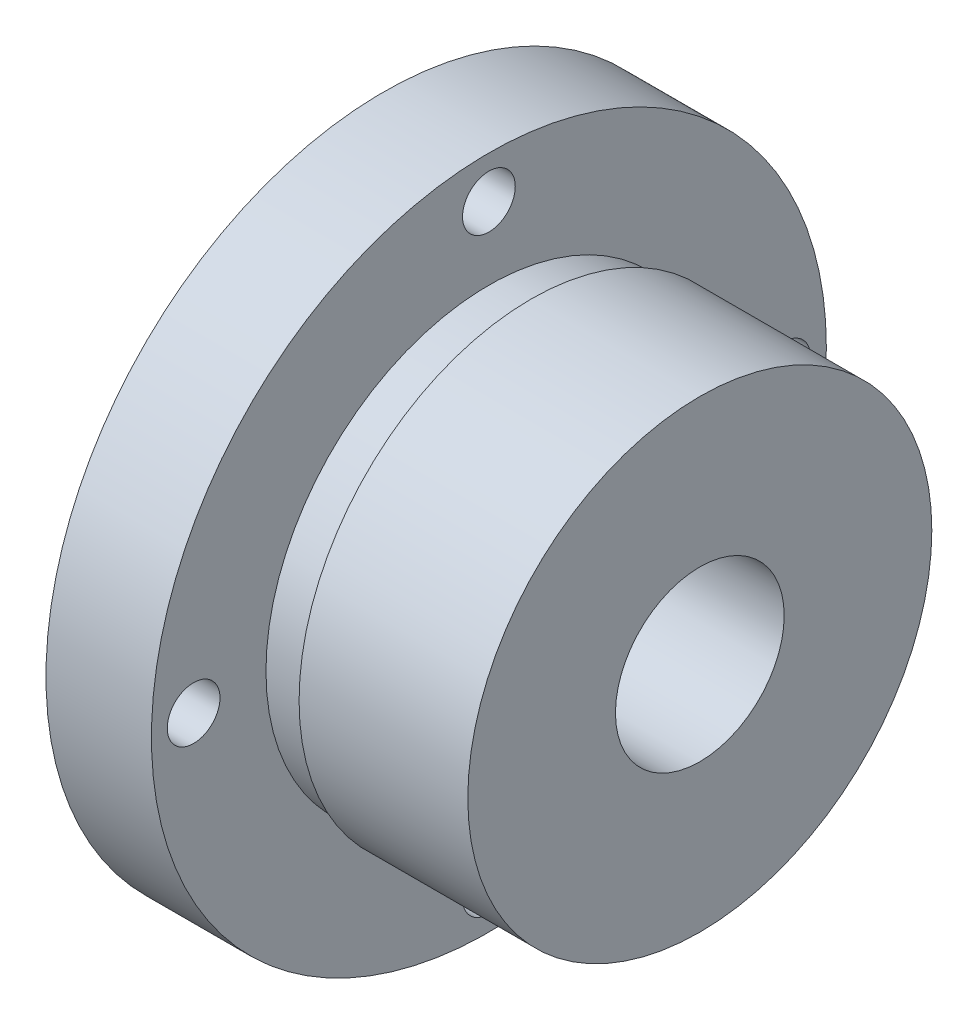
ISO-10303-21;
HEADER;
FILE_DESCRIPTION(('STEP AP214'),'2;1');
FILE_NAME('part.step','',(''),(''),'','','');
FILE_SCHEMA(('AUTOMOTIVE_DESIGN { 1 0 10303 214 1 1 1 1 }'));
ENDSEC;
DATA;
#1=APPLICATION_CONTEXT('core data for automotive mechanical design processes');
#2=APPLICATION_PROTOCOL_DEFINITION('international standard','automotive_design',2000,#1);
#3=PRODUCT_CONTEXT('',#1,'mechanical');
#4=PRODUCT('Part','Part','',(#3));
#5=PRODUCT_RELATED_PRODUCT_CATEGORY('part','',(#4));
#6=PRODUCT_DEFINITION_FORMATION('','',#4);
#7=PRODUCT_DEFINITION_CONTEXT('part definition',#1,'design');
#8=PRODUCT_DEFINITION('design','',#6,#7);
#9=PRODUCT_DEFINITION_SHAPE('','',#8);
#10=(LENGTH_UNIT() NAMED_UNIT(*) SI_UNIT(.MILLI.,.METRE.));
#11=(NAMED_UNIT(*) PLANE_ANGLE_UNIT() SI_UNIT($,.RADIAN.));
#12=(NAMED_UNIT(*) SI_UNIT($,.STERADIAN.) SOLID_ANGLE_UNIT());
#13=UNCERTAINTY_MEASURE_WITH_UNIT(LENGTH_MEASURE(1.E-05),#10,'distance_accuracy_value','');
#14=(GEOMETRIC_REPRESENTATION_CONTEXT(3) GLOBAL_UNCERTAINTY_ASSIGNED_CONTEXT((#13)) GLOBAL_UNIT_ASSIGNED_CONTEXT((#10,
#11,#12)) REPRESENTATION_CONTEXT('',''));
#15=CARTESIAN_POINT('',(0.,0.,0.));
#16=DIRECTION('',(0.,0.,1.));
#17=DIRECTION('',(1.,0.,0.));
#18=AXIS2_PLACEMENT_3D('',#15,#16,#17);
#19=CARTESIAN_POINT('',(0.,0.,0.));
#20=DIRECTION('',(-1.,0.,0.));
#21=DIRECTION('',(0.,0.,1.));
#22=AXIS2_PLACEMENT_3D('',#19,#20,#21);
#23=PLANE('',#22);
#24=CARTESIAN_POINT('',(0.,0.,0.));
#25=DIRECTION('',(-1.,0.,0.));
#26=DIRECTION('',(0.,0.,1.));
#27=AXIS2_PLACEMENT_3D('',#24,#25,#26);
#28=CIRCLE('',#27,4.);
#29=CARTESIAN_POINT('',(0.,0.,4.));
#30=VERTEX_POINT('',#29);
#31=EDGE_CURVE('E83',#30,#30,#28,.T.);
#32=ORIENTED_EDGE('',*,*,#31,.F.);
#33=EDGE_LOOP('',(#32));
#34=FACE_BOUND('',#33,.T.);
#35=CARTESIAN_POINT('',(0.,0.,-14.));
#36=DIRECTION('',(-1.,0.,0.));
#37=DIRECTION('',(0.,0.,1.));
#38=AXIS2_PLACEMENT_3D('',#35,#36,#37);
#39=CIRCLE('',#38,1.24999999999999);
#40=CARTESIAN_POINT('',(0.,0.,-12.75));
#41=VERTEX_POINT('',#40);
#42=EDGE_CURVE('E80',#41,#41,#39,.T.);
#43=ORIENTED_EDGE('',*,*,#42,.F.);
#44=EDGE_LOOP('',(#43));
#45=FACE_BOUND('',#44,.T.);
#46=CARTESIAN_POINT('',(0.,14.,1.46642301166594E-13));
#47=DIRECTION('',(-1.,0.,0.));
#48=DIRECTION('',(0.,0.,1.));
#49=AXIS2_PLACEMENT_3D('',#46,#47,#48);
#50=CIRCLE('',#49,1.24999999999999);
#51=CARTESIAN_POINT('',(0.,14.,1.25000000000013));
#52=VERTEX_POINT('',#51);
#53=EDGE_CURVE('E74',#52,#52,#50,.T.);
#54=ORIENTED_EDGE('',*,*,#53,.F.);
#55=EDGE_LOOP('',(#54));
#56=FACE_BOUND('',#55,.T.);
#57=CARTESIAN_POINT('',(0.,0.,14.));
#58=DIRECTION('',(-1.,0.,0.));
#59=DIRECTION('',(0.,0.,1.));
#60=AXIS2_PLACEMENT_3D('',#57,#58,#59);
#61=CIRCLE('',#60,1.24999999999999);
#62=CARTESIAN_POINT('',(0.,0.,15.25));
#63=VERTEX_POINT('',#62);
#64=EDGE_CURVE('E68',#63,#63,#61,.T.);
#65=ORIENTED_EDGE('',*,*,#64,.F.);
#66=EDGE_LOOP('',(#65));
#67=FACE_BOUND('',#66,.T.);
#68=CARTESIAN_POINT('',(0.,-14.,0.));
#69=DIRECTION('',(-1.,0.,0.));
#70=DIRECTION('',(0.,0.,1.));
#71=AXIS2_PLACEMENT_3D('',#68,#69,#70);
#72=CIRCLE('',#71,1.24999999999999);
#73=CARTESIAN_POINT('',(0.,-14.,1.24999999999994));
#74=VERTEX_POINT('',#73);
#75=EDGE_CURVE('E62',#74,#74,#72,.T.);
#76=ORIENTED_EDGE('',*,*,#75,.F.);
#77=EDGE_LOOP('',(#76));
#78=FACE_BOUND('',#77,.T.);
#79=CARTESIAN_POINT('',(0.,0.,0.));
#80=DIRECTION('',(1.,0.,0.));
#81=DIRECTION('',(0.,0.,-1.));
#82=AXIS2_PLACEMENT_3D('',#79,#80,#81);
#83=CIRCLE('',#82,16.);
#84=CARTESIAN_POINT('',(0.,0.,-16.));
#85=VERTEX_POINT('',#84);
#86=EDGE_CURVE('E10',#85,#85,#83,.T.);
#87=ORIENTED_EDGE('',*,*,#86,.F.);
#88=EDGE_LOOP('',(#87));
#89=FACE_BOUND('',#88,.T.);
#90=ADVANCED_FACE('F34',(#34,#45,#56,#67,#78,#89),#23,.T.);
#91=CARTESIAN_POINT('',(15.,0.,0.));
#92=DIRECTION('',(1.,0.,0.));
#93=DIRECTION('',(0.,0.,-1.));
#94=AXIS2_PLACEMENT_3D('',#91,#92,#93);
#95=CYLINDRICAL_SURFACE('',#94,16.);
#96=ORIENTED_EDGE('',*,*,#86,.T.);
#97=EDGE_LOOP('',(#96));
#98=FACE_BOUND('',#97,.T.);
#99=CARTESIAN_POINT('',(5.,0.,0.));
#100=DIRECTION('',(1.,0.,0.));
#101=DIRECTION('',(0.,0.,-1.));
#102=AXIS2_PLACEMENT_3D('',#99,#100,#101);
#103=CIRCLE('',#102,16.);
#104=CARTESIAN_POINT('',(5.,0.,-16.));
#105=VERTEX_POINT('',#104);
#106=EDGE_CURVE('E40',#105,#105,#103,.T.);
#107=ORIENTED_EDGE('',*,*,#106,.F.);
#108=EDGE_LOOP('',(#107));
#109=FACE_BOUND('',#108,.T.);
#110=ADVANCED_FACE('F94',(#98,#109),#95,.T.);
#111=CARTESIAN_POINT('',(5.,16.,0.));
#112=DIRECTION('',(1.,0.,0.));
#113=DIRECTION('',(0.,0.,-1.));
#114=AXIS2_PLACEMENT_3D('',#111,#112,#113);
#115=PLANE('',#114);
#116=CARTESIAN_POINT('',(5.,0.,-14.));
#117=DIRECTION('',(1.,0.,0.));
#118=DIRECTION('',(0.,0.,-1.));
#119=AXIS2_PLACEMENT_3D('',#116,#117,#118);
#120=CIRCLE('',#119,1.24999999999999);
#121=CARTESIAN_POINT('',(5.,0.,-15.25));
#122=VERTEX_POINT('',#121);
#123=EDGE_CURVE('E77',#122,#122,#120,.T.);
#124=ORIENTED_EDGE('',*,*,#123,.F.);
#125=EDGE_LOOP('',(#124));
#126=FACE_BOUND('',#125,.T.);
#127=CARTESIAN_POINT('',(5.,14.,1.46642301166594E-13));
#128=DIRECTION('',(1.,0.,0.));
#129=DIRECTION('',(0.,0.,-1.));
#130=AXIS2_PLACEMENT_3D('',#127,#128,#129);
#131=CIRCLE('',#130,1.24999999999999);
#132=CARTESIAN_POINT('',(5.,14.,-1.24999999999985));
#133=VERTEX_POINT('',#132);
#134=EDGE_CURVE('E71',#133,#133,#131,.T.);
#135=ORIENTED_EDGE('',*,*,#134,.F.);
#136=EDGE_LOOP('',(#135));
#137=FACE_BOUND('',#136,.T.);
#138=CARTESIAN_POINT('',(5.,0.,14.));
#139=DIRECTION('',(1.,0.,0.));
#140=DIRECTION('',(0.,0.,-1.));
#141=AXIS2_PLACEMENT_3D('',#138,#139,#140);
#142=CIRCLE('',#141,1.24999999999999);
#143=CARTESIAN_POINT('',(5.,0.,12.75));
#144=VERTEX_POINT('',#143);
#145=EDGE_CURVE('E65',#144,#144,#142,.T.);
#146=ORIENTED_EDGE('',*,*,#145,.F.);
#147=EDGE_LOOP('',(#146));
#148=FACE_BOUND('',#147,.T.);
#149=CARTESIAN_POINT('',(5.,-14.,0.));
#150=DIRECTION('',(1.,0.,0.));
#151=DIRECTION('',(0.,0.,-1.));
#152=AXIS2_PLACEMENT_3D('',#149,#150,#151);
#153=CIRCLE('',#152,1.24999999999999);
#154=CARTESIAN_POINT('',(5.,-14.,-1.25000000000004));
#155=VERTEX_POINT('',#154);
#156=EDGE_CURVE('E59',#155,#155,#153,.T.);
#157=ORIENTED_EDGE('',*,*,#156,.F.);
#158=EDGE_LOOP('',(#157));
#159=FACE_BOUND('',#158,.T.);
#160=ORIENTED_EDGE('',*,*,#106,.T.);
#161=EDGE_LOOP('',(#160));
#162=FACE_BOUND('',#161,.T.);
#163=CARTESIAN_POINT('',(5.,0.,0.));
#164=DIRECTION('',(1.,0.,0.));
#165=DIRECTION('',(0.,0.,-1.));
#166=AXIS2_PLACEMENT_3D('',#163,#164,#165);
#167=CIRCLE('',#166,10.57);
#168=CARTESIAN_POINT('',(5.,0.,-10.57));
#169=VERTEX_POINT('',#168);
#170=EDGE_CURVE('E44',#169,#169,#167,.T.);
#171=ORIENTED_EDGE('',*,*,#170,.F.);
#172=EDGE_LOOP('',(#171));
#173=FACE_BOUND('',#172,.T.);
#174=ADVANCED_FACE('F112',(#126,#137,#148,#159,#162,#173),#115,.T.);
#175=CARTESIAN_POINT('',(15.,0.,0.));
#176=DIRECTION('',(1.,0.,0.));
#177=DIRECTION('',(0.,0.,-1.));
#178=AXIS2_PLACEMENT_3D('',#175,#176,#177);
#179=CYLINDRICAL_SURFACE('',#178,10.57);
#180=ORIENTED_EDGE('',*,*,#170,.T.);
#181=EDGE_LOOP('',(#180));
#182=FACE_BOUND('',#181,.T.);
#183=CARTESIAN_POINT('',(7.,0.,0.));
#184=DIRECTION('',(1.,0.,0.));
#185=DIRECTION('',(0.,0.,-1.));
#186=AXIS2_PLACEMENT_3D('',#183,#184,#185);
#187=CIRCLE('',#186,10.57);
#188=CARTESIAN_POINT('',(7.,0.,-10.57));
#189=VERTEX_POINT('',#188);
#190=EDGE_CURVE('E48',#189,#189,#187,.T.);
#191=ORIENTED_EDGE('',*,*,#190,.F.);
#192=EDGE_LOOP('',(#191));
#193=FACE_BOUND('',#192,.T.);
#194=ADVANCED_FACE('F114',(#182,#193),#179,.T.);
#195=CARTESIAN_POINT('',(7.,10.57,0.));
#196=DIRECTION('',(-1.,0.,0.));
#197=DIRECTION('',(0.,0.,1.));
#198=AXIS2_PLACEMENT_3D('',#195,#196,#197);
#199=PLANE('',#198);
#200=ORIENTED_EDGE('',*,*,#190,.T.);
#201=EDGE_LOOP('',(#200));
#202=FACE_BOUND('',#201,.T.);
#203=CARTESIAN_POINT('',(7.,0.,0.));
#204=DIRECTION('',(1.,0.,0.));
#205=DIRECTION('',(0.,0.,-1.));
#206=AXIS2_PLACEMENT_3D('',#203,#204,#205);
#207=CIRCLE('',#206,11.);
#208=CARTESIAN_POINT('',(7.,0.,-11.));
#209=VERTEX_POINT('',#208);
#210=EDGE_CURVE('E53',#209,#209,#207,.T.);
#211=ORIENTED_EDGE('',*,*,#210,.F.);
#212=EDGE_LOOP('',(#211));
#213=FACE_BOUND('',#212,.T.);
#214=ADVANCED_FACE('F122',(#202,#213),#199,.T.);
#215=CARTESIAN_POINT('',(15.,0.,0.));
#216=DIRECTION('',(1.,0.,0.));
#217=DIRECTION('',(0.,0.,-1.));
#218=AXIS2_PLACEMENT_3D('',#215,#216,#217);
#219=CYLINDRICAL_SURFACE('',#218,11.);
#220=ORIENTED_EDGE('',*,*,#210,.T.);
#221=EDGE_LOOP('',(#220));
#222=FACE_BOUND('',#221,.T.);
#223=CARTESIAN_POINT('',(15.,0.,0.));
#224=DIRECTION('',(1.,0.,0.));
#225=DIRECTION('',(0.,0.,-1.));
#226=AXIS2_PLACEMENT_3D('',#223,#224,#225);
#227=CIRCLE('',#226,11.);
#228=CARTESIAN_POINT('',(15.,0.,-11.));
#229=VERTEX_POINT('',#228);
#230=EDGE_CURVE('E56',#229,#229,#227,.T.);
#231=ORIENTED_EDGE('',*,*,#230,.F.);
#232=EDGE_LOOP('',(#231));
#233=FACE_BOUND('',#232,.T.);
#234=ADVANCED_FACE('F128',(#222,#233),#219,.T.);
#235=CARTESIAN_POINT('',(15.,11.,0.));
#236=DIRECTION('',(1.,0.,0.));
#237=DIRECTION('',(0.,0.,-1.));
#238=AXIS2_PLACEMENT_3D('',#235,#236,#237);
#239=PLANE('',#238);
#240=CARTESIAN_POINT('',(15.,0.,0.));
#241=DIRECTION('',(1.,0.,0.));
#242=DIRECTION('',(0.,0.,-1.));
#243=AXIS2_PLACEMENT_3D('',#240,#241,#242);
#244=CIRCLE('',#243,4.);
#245=CARTESIAN_POINT('',(15.,0.,-4.));
#246=VERTEX_POINT('',#245);
#247=EDGE_CURVE('E84',#246,#246,#244,.F.);
#248=ORIENTED_EDGE('',*,*,#247,.T.);
#249=EDGE_LOOP('',(#248));
#250=FACE_BOUND('',#249,.T.);
#251=ORIENTED_EDGE('',*,*,#230,.T.);
#252=EDGE_LOOP('',(#251));
#253=FACE_BOUND('',#252,.T.);
#254=ADVANCED_FACE('F108',(#250,#253),#239,.T.);
#255=CARTESIAN_POINT('',(0.,-14.,0.));
#256=DIRECTION('',(-1.,0.,0.));
#257=DIRECTION('',(0.,0.,1.));
#258=AXIS2_PLACEMENT_3D('',#255,#256,#257);
#259=CYLINDRICAL_SURFACE('',#258,1.24999999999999);
#260=ORIENTED_EDGE('',*,*,#75,.T.);
#261=EDGE_LOOP('',(#260));
#262=FACE_BOUND('',#261,.T.);
#263=ORIENTED_EDGE('',*,*,#156,.T.);
#264=EDGE_LOOP('',(#263));
#265=FACE_BOUND('',#264,.T.);
#266=ADVANCED_FACE('F104',(#262,#265),#259,.F.);
#267=CARTESIAN_POINT('',(0.,0.,14.));
#268=DIRECTION('',(-1.,0.,0.));
#269=DIRECTION('',(0.,0.,1.));
#270=AXIS2_PLACEMENT_3D('',#267,#268,#269);
#271=CYLINDRICAL_SURFACE('',#270,1.24999999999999);
#272=ORIENTED_EDGE('',*,*,#64,.T.);
#273=EDGE_LOOP('',(#272));
#274=FACE_BOUND('',#273,.T.);
#275=ORIENTED_EDGE('',*,*,#145,.T.);
#276=EDGE_LOOP('',(#275));
#277=FACE_BOUND('',#276,.T.);
#278=ADVANCED_FACE('F107',(#274,#277),#271,.F.);
#279=CARTESIAN_POINT('',(0.,14.,1.46642301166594E-13));
#280=DIRECTION('',(-1.,0.,0.));
#281=DIRECTION('',(0.,0.,1.));
#282=AXIS2_PLACEMENT_3D('',#279,#280,#281);
#283=CYLINDRICAL_SURFACE('',#282,1.24999999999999);
#284=ORIENTED_EDGE('',*,*,#53,.T.);
#285=EDGE_LOOP('',(#284));
#286=FACE_BOUND('',#285,.T.);
#287=ORIENTED_EDGE('',*,*,#134,.T.);
#288=EDGE_LOOP('',(#287));
#289=FACE_BOUND('',#288,.T.);
#290=ADVANCED_FACE('F188',(#286,#289),#283,.F.);
#291=CARTESIAN_POINT('',(0.,0.,-14.));
#292=DIRECTION('',(-1.,0.,0.));
#293=DIRECTION('',(0.,0.,1.));
#294=AXIS2_PLACEMENT_3D('',#291,#292,#293);
#295=CYLINDRICAL_SURFACE('',#294,1.24999999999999);
#296=ORIENTED_EDGE('',*,*,#42,.T.);
#297=EDGE_LOOP('',(#296));
#298=FACE_BOUND('',#297,.T.);
#299=ORIENTED_EDGE('',*,*,#123,.T.);
#300=EDGE_LOOP('',(#299));
#301=FACE_BOUND('',#300,.T.);
#302=ADVANCED_FACE('F197',(#298,#301),#295,.F.);
#303=CARTESIAN_POINT('',(15.001,0.,0.));
#304=DIRECTION('',(-1.,0.,0.));
#305=DIRECTION('',(0.,0.,1.));
#306=AXIS2_PLACEMENT_3D('',#303,#304,#305);
#307=CYLINDRICAL_SURFACE('',#306,4.);
#308=ORIENTED_EDGE('',*,*,#247,.F.);
#309=EDGE_LOOP('',(#308));
#310=FACE_BOUND('',#309,.T.);
#311=ORIENTED_EDGE('',*,*,#31,.T.);
#312=EDGE_LOOP('',(#311));
#313=FACE_BOUND('',#312,.T.);
#314=ADVANCED_FACE('F90',(#310,#313),#307,.F.);
#315=CLOSED_SHELL('',(#90,#110,#174,#194,#214,#234,#254,#266,#278,#290,#302,#314));
#316=MANIFOLD_SOLID_BREP('B2',#315);
#317=ADVANCED_BREP_SHAPE_REPRESENTATION('',(#18,#316),#14);
#318=SHAPE_DEFINITION_REPRESENTATION(#9,#317);
ENDSEC;
END-ISO-10303-21;
